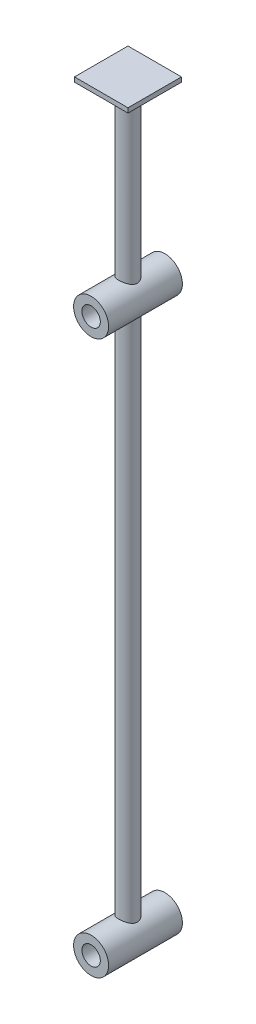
from build123d import *

# Parameters (mm, degrees)
EXTRUSION1_DEPTH        = 40
EXTRUSION1_DEPTH_BACK   = 40
ESQUISSE1_R             = 19
ESQUISSE1_R_2           = 10
ESQUISSE2_R             = 10
EXTRUSION2_DEPTH        = 800
ESQUISSE3_W             = 58
ESQUISSE3_H             = 58
EXTRUSION3_DEPTH        = 5
ESQUISSE4_R             = 19
EXTRUSION4_DEPTH        = 80
ESQUISSE5_R             = 10
ENL_V_MAT_EXTRU_1_DEPTH = 810.48502149


with BuildPart() as part:
    # Esquisse1 → Extrusion1 (new, two sides: drawn at the far end of the back side and taken through both)
    with BuildSketch(Plane.XY.offset(-EXTRUSION1_DEPTH_BACK)):
        Circle(ESQUISSE1_R)
        Circle(ESQUISSE1_R_2, mode=Mode.SUBTRACT)
    extrude(amount=EXTRUSION1_DEPTH + EXTRUSION1_DEPTH_BACK)

    # Esquisse2 → Extrusion2 (add)
    with BuildSketch(Plane(origin=(0, 0, 0), x_dir=(1, 0, 0), z_dir=(0, 1, 0))):
        with Locations(Location((0, 0, 0), (0, 0, 90))):
            Circle(ESQUISSE2_R)
    extrude(amount=EXTRUSION2_DEPTH)

    # Esquisse3 → Extrusion3 (add)
    with BuildSketch(Plane(origin=(0, 800, 0), x_dir=(-1, 0, 0), z_dir=(0, 1, 0))):
        Rectangle(ESQUISSE3_W, ESQUISSE3_H)
    extrude(amount=EXTRUSION3_DEPTH)

    # Esquisse4 → Extrusion4 (add)
    with BuildSketch(Plane.XY.offset(40)):
        with Locations((0, 600)):
            Circle(ESQUISSE4_R)
    extrude(amount=-EXTRUSION4_DEPTH)

    # Esquisse5 → Enl_v. mat.-Extru.1 (cut, through all)
    with BuildSketch(Plane.XY.offset(40)):
        with Locations((0, 600)):
            Circle(ESQUISSE5_R)
    extrude(amount=-ENL_V_MAT_EXTRU_1_DEPTH, mode=Mode.SUBTRACT)


solid = part.part
